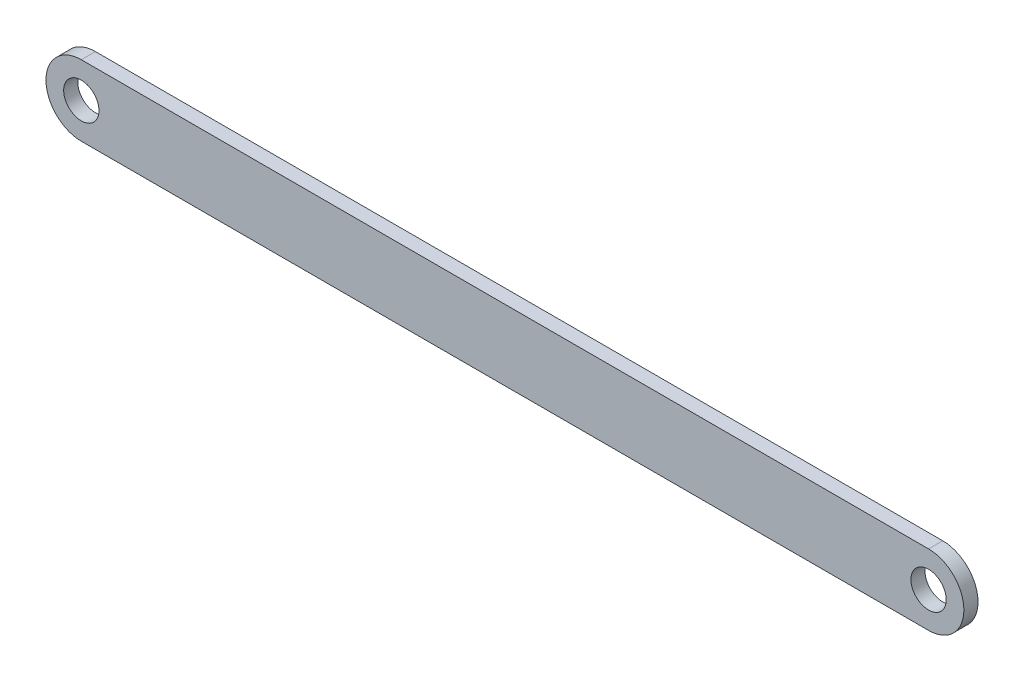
ISO-10303-21;
HEADER;
FILE_DESCRIPTION(('STEP AP214'),'2;1');
FILE_NAME('part.step','',(''),(''),'','','');
FILE_SCHEMA(('AUTOMOTIVE_DESIGN { 1 0 10303 214 1 1 1 1 }'));
ENDSEC;
DATA;
#1=APPLICATION_CONTEXT('core data for automotive mechanical design processes');
#2=APPLICATION_PROTOCOL_DEFINITION('international standard','automotive_design',2000,#1);
#3=PRODUCT_CONTEXT('',#1,'mechanical');
#4=PRODUCT('Part','Part','',(#3));
#5=PRODUCT_RELATED_PRODUCT_CATEGORY('part','',(#4));
#6=PRODUCT_DEFINITION_FORMATION('','',#4);
#7=PRODUCT_DEFINITION_CONTEXT('part definition',#1,'design');
#8=PRODUCT_DEFINITION('design','',#6,#7);
#9=PRODUCT_DEFINITION_SHAPE('','',#8);
#10=(LENGTH_UNIT() NAMED_UNIT(*) SI_UNIT(.MILLI.,.METRE.));
#11=(NAMED_UNIT(*) PLANE_ANGLE_UNIT() SI_UNIT($,.RADIAN.));
#12=(NAMED_UNIT(*) SI_UNIT($,.STERADIAN.) SOLID_ANGLE_UNIT());
#13=UNCERTAINTY_MEASURE_WITH_UNIT(LENGTH_MEASURE(1.E-05),#10,'distance_accuracy_value','');
#14=(GEOMETRIC_REPRESENTATION_CONTEXT(3) GLOBAL_UNCERTAINTY_ASSIGNED_CONTEXT((#13)) GLOBAL_UNIT_ASSIGNED_CONTEXT((#10,
#11,#12)) REPRESENTATION_CONTEXT('',''));
#15=CARTESIAN_POINT('',(0.,0.,0.));
#16=DIRECTION('',(0.,0.,1.));
#17=DIRECTION('',(1.,0.,0.));
#18=AXIS2_PLACEMENT_3D('',#15,#16,#17);
#19=CARTESIAN_POINT('',(-60.,0.,1.));
#20=DIRECTION('',(0.,0.,1.));
#21=DIRECTION('',(1.,0.,0.));
#22=AXIS2_PLACEMENT_3D('',#19,#20,#21);
#23=PLANE('',#22);
#24=CARTESIAN_POINT('',(-60.,0.,1.));
#25=DIRECTION('',(0.,0.,1.));
#26=DIRECTION('',(1.,0.,0.));
#27=AXIS2_PLACEMENT_3D('',#24,#25,#26);
#28=CIRCLE('',#27,2.5);
#29=CARTESIAN_POINT('',(-57.5,0.,1.));
#30=VERTEX_POINT('',#29);
#31=EDGE_CURVE('E112',#30,#30,#28,.T.);
#32=ORIENTED_EDGE('',*,*,#31,.F.);
#33=EDGE_LOOP('',(#32));
#34=FACE_BOUND('',#33,.T.);
#35=CARTESIAN_POINT('',(-60.,0.,1.));
#36=DIRECTION('',(0.,0.,1.));
#37=DIRECTION('',(1.,0.,0.));
#38=AXIS2_PLACEMENT_3D('',#35,#36,#37);
#39=CIRCLE('',#38,5.);
#40=CARTESIAN_POINT('',(-60.,5.00000000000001,1.));
#41=VERTEX_POINT('',#40);
#42=CARTESIAN_POINT('',(-60.,-4.99999999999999,1.));
#43=VERTEX_POINT('',#42);
#44=EDGE_CURVE('E92',#41,#43,#39,.T.);
#45=ORIENTED_EDGE('',*,*,#44,.T.);
#46=DIRECTION('',(1.,0.,0.));
#47=VECTOR('',#46,1.);
#48=CARTESIAN_POINT('',(-60.,-4.99999999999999,1.));
#49=LINE('',#48,#47);
#50=CARTESIAN_POINT('',(60.,-5.,1.));
#51=VERTEX_POINT('',#50);
#52=EDGE_CURVE('E87',#43,#51,#49,.T.);
#53=ORIENTED_EDGE('',*,*,#52,.T.);
#54=CARTESIAN_POINT('',(60.,0.,1.));
#55=DIRECTION('',(0.,0.,1.));
#56=DIRECTION('',(1.,0.,0.));
#57=AXIS2_PLACEMENT_3D('',#54,#55,#56);
#58=CIRCLE('',#57,5.);
#59=CARTESIAN_POINT('',(60.,5.00000000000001,1.));
#60=VERTEX_POINT('',#59);
#61=EDGE_CURVE('E90',#51,#60,#58,.T.);
#62=ORIENTED_EDGE('',*,*,#61,.T.);
#63=DIRECTION('',(-1.,0.,0.));
#64=VECTOR('',#63,1.);
#65=CARTESIAN_POINT('',(-60.,5.00000000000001,1.));
#66=LINE('',#65,#64);
#67=EDGE_CURVE('E57',#60,#41,#66,.T.);
#68=ORIENTED_EDGE('',*,*,#67,.T.);
#69=EDGE_LOOP('',(#45,#53,#62,#68));
#70=FACE_BOUND('',#69,.T.);
#71=CARTESIAN_POINT('',(60.,0.,1.));
#72=DIRECTION('',(0.,0.,1.));
#73=DIRECTION('',(1.,0.,0.));
#74=AXIS2_PLACEMENT_3D('',#71,#72,#73);
#75=CIRCLE('',#74,2.5);
#76=CARTESIAN_POINT('',(62.5,0.,1.));
#77=VERTEX_POINT('',#76);
#78=EDGE_CURVE('E134',#77,#77,#75,.T.);
#79=ORIENTED_EDGE('',*,*,#78,.F.);
#80=EDGE_LOOP('',(#79));
#81=FACE_BOUND('',#80,.T.);
#82=ADVANCED_FACE('F39',(#34,#70,#81),#23,.T.);
#83=CARTESIAN_POINT('',(-60.,0.,-1.));
#84=DIRECTION('',(0.,0.,1.));
#85=DIRECTION('',(1.,0.,0.));
#86=AXIS2_PLACEMENT_3D('',#83,#84,#85);
#87=PLANE('',#86);
#88=CARTESIAN_POINT('',(-60.,0.,-1.));
#89=DIRECTION('',(0.,0.,1.));
#90=DIRECTION('',(1.,0.,0.));
#91=AXIS2_PLACEMENT_3D('',#88,#89,#90);
#92=CIRCLE('',#91,5.);
#93=CARTESIAN_POINT('',(-60.,5.00000000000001,-1.));
#94=VERTEX_POINT('',#93);
#95=CARTESIAN_POINT('',(-60.,-4.99999999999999,-1.));
#96=VERTEX_POINT('',#95);
#97=EDGE_CURVE('E108',#94,#96,#92,.T.);
#98=ORIENTED_EDGE('',*,*,#97,.F.);
#99=DIRECTION('',(-1.,0.,0.));
#100=VECTOR('',#99,1.);
#101=CARTESIAN_POINT('',(-60.,5.00000000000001,-1.));
#102=LINE('',#101,#100);
#103=CARTESIAN_POINT('',(60.,5.00000000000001,-1.));
#104=VERTEX_POINT('',#103);
#105=EDGE_CURVE('E80',#104,#94,#102,.T.);
#106=ORIENTED_EDGE('',*,*,#105,.F.);
#107=CARTESIAN_POINT('',(60.,0.,-1.));
#108=DIRECTION('',(0.,0.,1.));
#109=DIRECTION('',(1.,0.,0.));
#110=AXIS2_PLACEMENT_3D('',#107,#108,#109);
#111=CIRCLE('',#110,5.);
#112=CARTESIAN_POINT('',(60.,-5.,-1.));
#113=VERTEX_POINT('',#112);
#114=EDGE_CURVE('E74',#113,#104,#111,.T.);
#115=ORIENTED_EDGE('',*,*,#114,.F.);
#116=DIRECTION('',(1.,0.,0.));
#117=VECTOR('',#116,1.);
#118=CARTESIAN_POINT('',(-60.,-4.99999999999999,-1.));
#119=LINE('',#118,#117);
#120=EDGE_CURVE('E97',#96,#113,#119,.T.);
#121=ORIENTED_EDGE('',*,*,#120,.F.);
#122=EDGE_LOOP('',(#98,#106,#115,#121));
#123=FACE_BOUND('',#122,.T.);
#124=CARTESIAN_POINT('',(-60.,0.,-1.));
#125=DIRECTION('',(0.,0.,1.));
#126=DIRECTION('',(1.,0.,0.));
#127=AXIS2_PLACEMENT_3D('',#124,#125,#126);
#128=CIRCLE('',#127,2.5);
#129=CARTESIAN_POINT('',(-57.5,0.,-1.));
#130=VERTEX_POINT('',#129);
#131=EDGE_CURVE('E130',#130,#130,#128,.T.);
#132=ORIENTED_EDGE('',*,*,#131,.T.);
#133=EDGE_LOOP('',(#132));
#134=FACE_BOUND('',#133,.T.);
#135=CARTESIAN_POINT('',(60.,0.,-1.));
#136=DIRECTION('',(0.,0.,1.));
#137=DIRECTION('',(1.,0.,0.));
#138=AXIS2_PLACEMENT_3D('',#135,#136,#137);
#139=CIRCLE('',#138,2.5);
#140=CARTESIAN_POINT('',(62.5,0.,-1.));
#141=VERTEX_POINT('',#140);
#142=EDGE_CURVE('E138',#141,#141,#139,.T.);
#143=ORIENTED_EDGE('',*,*,#142,.T.);
#144=EDGE_LOOP('',(#143));
#145=FACE_BOUND('',#144,.T.);
#146=ADVANCED_FACE('F125',(#123,#134,#145),#87,.F.);
#147=CARTESIAN_POINT('',(-60.,0.,1.));
#148=DIRECTION('',(0.,0.,-1.));
#149=DIRECTION('',(-1.,0.,0.));
#150=AXIS2_PLACEMENT_3D('',#147,#148,#149);
#151=CYLINDRICAL_SURFACE('',#150,5.);
#152=ORIENTED_EDGE('',*,*,#97,.T.);
#153=DIRECTION('',(0.,0.,-1.));
#154=VECTOR('',#153,1.);
#155=CARTESIAN_POINT('',(-60.,-4.99999999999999,1.));
#156=LINE('',#155,#154);
#157=EDGE_CURVE('E11',#43,#96,#156,.T.);
#158=ORIENTED_EDGE('',*,*,#157,.F.);
#159=ORIENTED_EDGE('',*,*,#44,.F.);
#160=DIRECTION('',(0.,0.,-1.));
#161=VECTOR('',#160,1.);
#162=CARTESIAN_POINT('',(-60.,5.00000000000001,1.));
#163=LINE('',#162,#161);
#164=EDGE_CURVE('E104',#41,#94,#163,.T.);
#165=ORIENTED_EDGE('',*,*,#164,.T.);
#166=EDGE_LOOP('',(#152,#158,#159,#165));
#167=FACE_BOUND('',#166,.T.);
#168=ADVANCED_FACE('F41',(#167),#151,.T.);
#169=CARTESIAN_POINT('',(-60.,-4.99999999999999,1.));
#170=DIRECTION('',(0.,1.,0.));
#171=DIRECTION('',(0.,0.,1.));
#172=AXIS2_PLACEMENT_3D('',#169,#170,#171);
#173=PLANE('',#172);
#174=ORIENTED_EDGE('',*,*,#120,.T.);
#175=DIRECTION('',(0.,0.,-1.));
#176=VECTOR('',#175,1.);
#177=CARTESIAN_POINT('',(60.,-5.,1.));
#178=LINE('',#177,#176);
#179=EDGE_CURVE('E49',#51,#113,#178,.T.);
#180=ORIENTED_EDGE('',*,*,#179,.F.);
#181=ORIENTED_EDGE('',*,*,#52,.F.);
#182=ORIENTED_EDGE('',*,*,#157,.T.);
#183=EDGE_LOOP('',(#174,#180,#181,#182));
#184=FACE_BOUND('',#183,.T.);
#185=ADVANCED_FACE('F96',(#184),#173,.F.);
#186=CARTESIAN_POINT('',(60.,0.,1.));
#187=DIRECTION('',(0.,0.,-1.));
#188=DIRECTION('',(-1.,0.,0.));
#189=AXIS2_PLACEMENT_3D('',#186,#187,#188);
#190=CYLINDRICAL_SURFACE('',#189,5.);
#191=ORIENTED_EDGE('',*,*,#114,.T.);
#192=DIRECTION('',(0.,0.,-1.));
#193=VECTOR('',#192,1.);
#194=CARTESIAN_POINT('',(60.,5.00000000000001,1.));
#195=LINE('',#194,#193);
#196=EDGE_CURVE('E99',#60,#104,#195,.T.);
#197=ORIENTED_EDGE('',*,*,#196,.F.);
#198=ORIENTED_EDGE('',*,*,#61,.F.);
#199=ORIENTED_EDGE('',*,*,#179,.T.);
#200=EDGE_LOOP('',(#191,#197,#198,#199));
#201=FACE_BOUND('',#200,.T.);
#202=ADVANCED_FACE('F100',(#201),#190,.T.);
#203=CARTESIAN_POINT('',(-60.,5.00000000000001,1.));
#204=DIRECTION('',(0.,-1.,0.));
#205=DIRECTION('',(1.,0.,0.));
#206=AXIS2_PLACEMENT_3D('',#203,#204,#205);
#207=PLANE('',#206);
#208=ORIENTED_EDGE('',*,*,#105,.T.);
#209=ORIENTED_EDGE('',*,*,#164,.F.);
#210=ORIENTED_EDGE('',*,*,#67,.F.);
#211=ORIENTED_EDGE('',*,*,#196,.T.);
#212=EDGE_LOOP('',(#208,#209,#210,#211));
#213=FACE_BOUND('',#212,.T.);
#214=ADVANCED_FACE('F122',(#213),#207,.F.);
#215=CARTESIAN_POINT('',(-60.,0.,1.));
#216=DIRECTION('',(0.,0.,-1.));
#217=DIRECTION('',(-1.,0.,0.));
#218=AXIS2_PLACEMENT_3D('',#215,#216,#217);
#219=CYLINDRICAL_SURFACE('',#218,2.5);
#220=ORIENTED_EDGE('',*,*,#31,.T.);
#221=EDGE_LOOP('',(#220));
#222=FACE_BOUND('',#221,.T.);
#223=ORIENTED_EDGE('',*,*,#131,.F.);
#224=EDGE_LOOP('',(#223));
#225=FACE_BOUND('',#224,.T.);
#226=ADVANCED_FACE('F157',(#222,#225),#219,.F.);
#227=CARTESIAN_POINT('',(60.,0.,1.));
#228=DIRECTION('',(0.,0.,-1.));
#229=DIRECTION('',(-1.,0.,0.));
#230=AXIS2_PLACEMENT_3D('',#227,#228,#229);
#231=CYLINDRICAL_SURFACE('',#230,2.5);
#232=ORIENTED_EDGE('',*,*,#78,.T.);
#233=EDGE_LOOP('',(#232));
#234=FACE_BOUND('',#233,.T.);
#235=ORIENTED_EDGE('',*,*,#142,.F.);
#236=EDGE_LOOP('',(#235));
#237=FACE_BOUND('',#236,.T.);
#238=ADVANCED_FACE('F146',(#234,#237),#231,.F.);
#239=CLOSED_SHELL('',(#82,#146,#168,#185,#202,#214,#226,#238));
#240=MANIFOLD_SOLID_BREP('B2',#239);
#241=ADVANCED_BREP_SHAPE_REPRESENTATION('',(#18,#240),#14);
#242=SHAPE_DEFINITION_REPRESENTATION(#9,#241);
ENDSEC;
END-ISO-10303-21;
